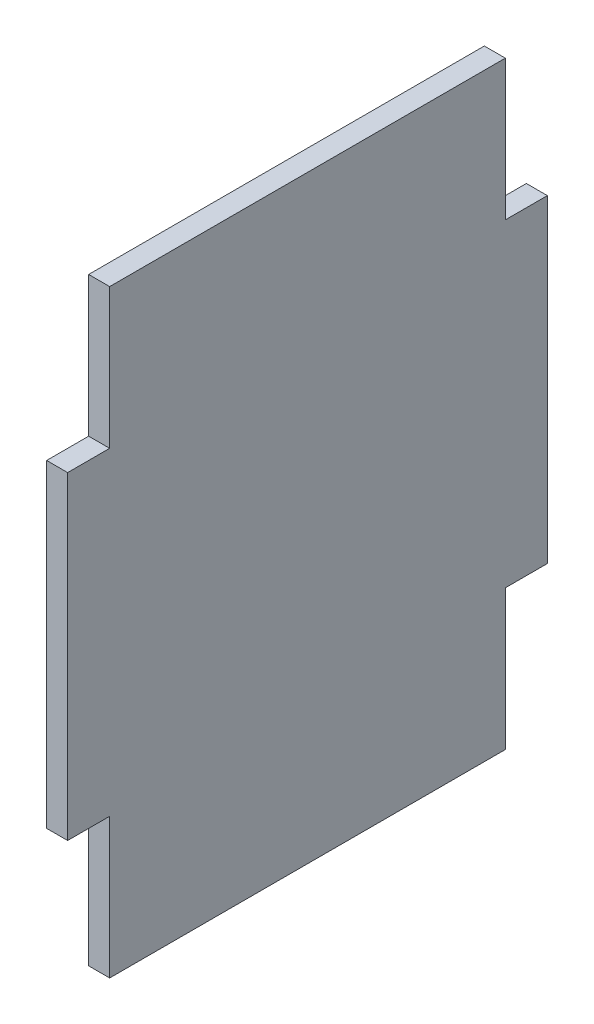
from build123d import *

# Parameters (mm, degrees)
ESQUISSE1_W               = 137
ESQUISSE1_H               = 171
BOSS_EXTRU_1_DEPTH        = 6
ESQUISSE2_W               = 12
ESQUISSE2_H               = 40
ENL_V_MAT_EXTRU_1_DEPTH   = 6
SYM_TRIE2_COPY_1_SKETCH_W = 12
SYM_TRIE2_COPY_1_SKETCH_H = 40
SYM_TRIE2_COPY_1_DEPTH    = 6


with BuildPart() as part:
    # Esquisse1 → Boss.-Extru.1 (new body)
    with BuildSketch(Plane(origin=(0, 0, 0), x_dir=(0, 0, -1), z_dir=(1, 0, 0))):
        Rectangle(ESQUISSE1_W, ESQUISSE1_H)
    extrude(amount=BOSS_EXTRU_1_DEPTH)

    # Esquisse2 → Enl_v. mat.-Extru.1 (cut)
    with BuildSketch(Plane(origin=(6, 0, 0), x_dir=(0, 0, -1), z_dir=(1, 0, 0))):
        with Locations((-62.5, 65.5)):
            Rectangle(ESQUISSE2_W, ESQUISSE2_H)
    enl_v_mat_extru_1 = extrude(amount=-ENL_V_MAT_EXTRU_1_DEPTH, mode=Mode.SUBTRACT)

    # Sym_trie1: Enl_v. mat.-Extru.1 across plane
    add(enl_v_mat_extru_1.mirror(Plane.ZX), mode=Mode.SUBTRACT)

    # Sym_trie2: Enl_v. mat.-Extru.1 across plane
    add(enl_v_mat_extru_1.mirror(Plane.XY), mode=Mode.SUBTRACT)

    # Sym_trie2 copy 1 sketch → Sym_trie2 copy 1 (cut)
    with BuildSketch(Plane(origin=(6, 0, 0), x_dir=(0, 0, 1), z_dir=(1, 0, 0))):
        with Locations((-62.5, 65.5)):
            Rectangle(SYM_TRIE2_COPY_1_SKETCH_W, SYM_TRIE2_COPY_1_SKETCH_H)
    extrude(amount=-SYM_TRIE2_COPY_1_DEPTH, mode=Mode.SUBTRACT)


solid = part.part
